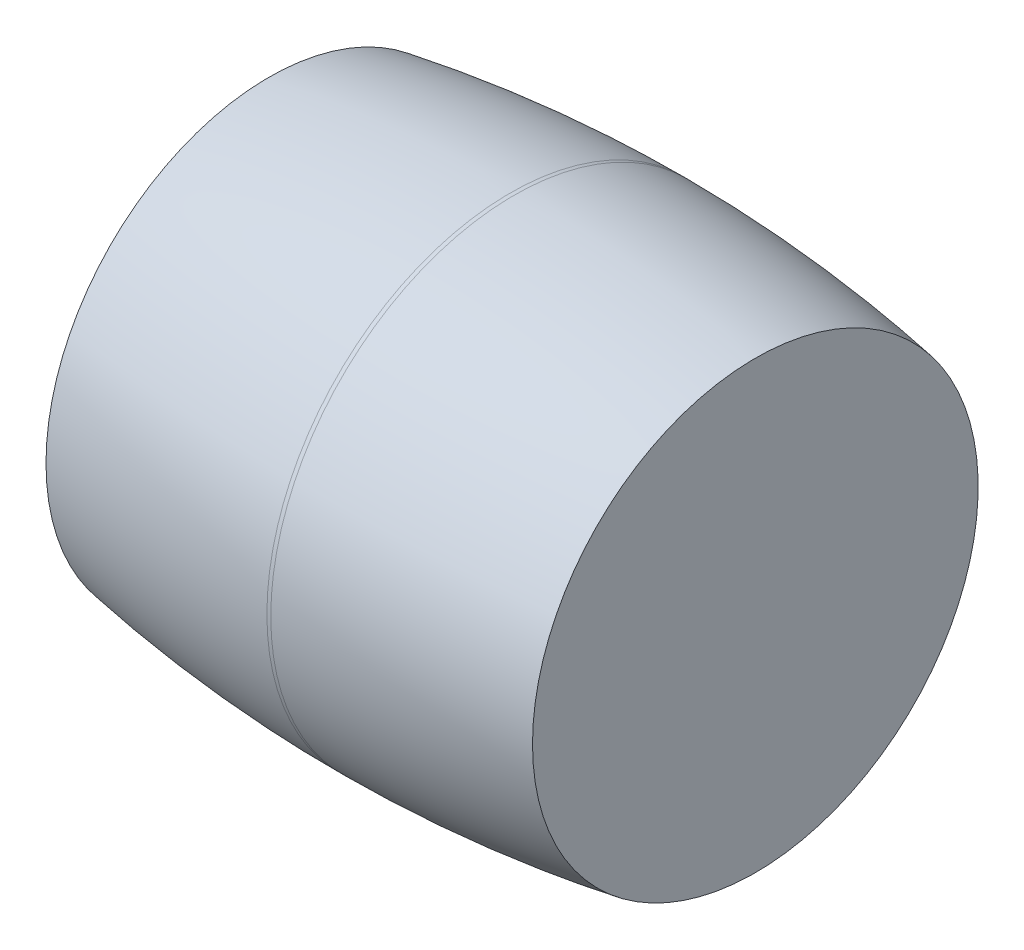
from build123d import *


with BuildPart() as part:
    # Sketch1 → Revolve1 (revolve)
    with BuildSketch(Plane.XY, mode=Mode.PRIVATE) as revolve1_sk:
        with BuildLine():
            Line((-3.175, 0), (3.175, 0))
            Line((3.175, 0), (3.175, 2.908570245))
            ThreePointArc((3.175, 2.908570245), (1.605735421, 3.10722212), (0.0254, 3.175))
            Line((0.0254, 3.175), (-0.0254, 3.175))
            ThreePointArc((-0.0254, 3.175), (-1.605735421, 3.10722212), (-3.175, 2.908570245))
            Line((-3.175, 2.908570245), (-3.175, 0))
        make_face()
    revolve(revolve1_sk.sketch.rotate(Axis((0, 0, 0), (1, 0, 0)), 90), axis=Axis((0, 0, 0), (1, 0, 0)))


solid = part.part
